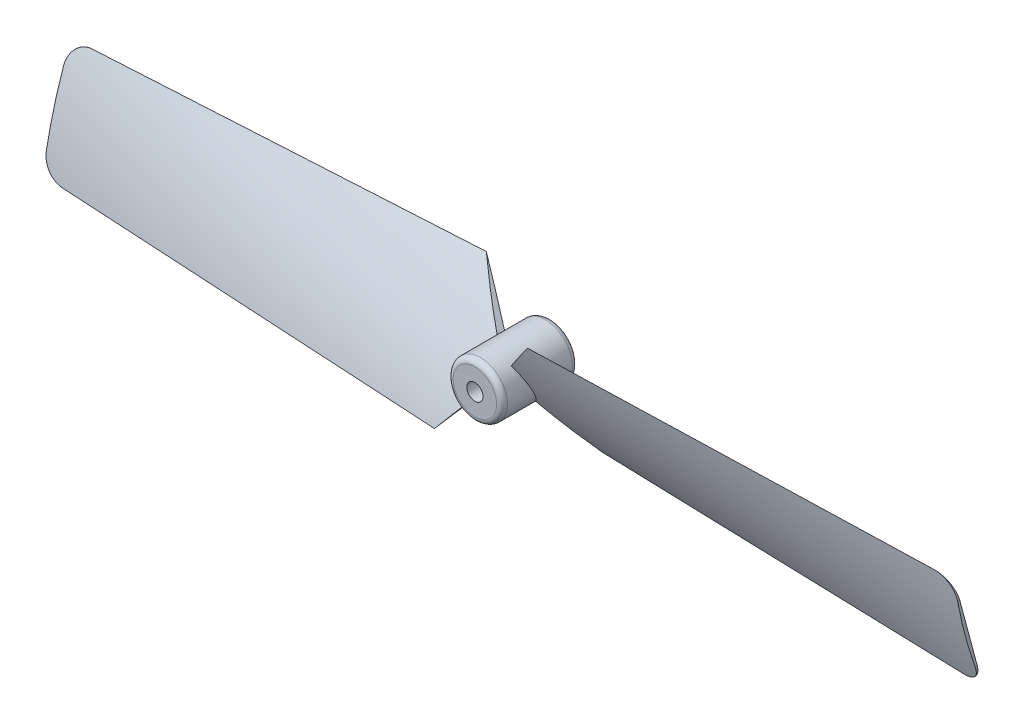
from build123d import *

# Parameters (mm, degrees)
ESQUISSE1_R                  = 2.5
EXTRUSION1_DEPTH             = 3.5
ENL_V_MAT_EXTRU_1_DEPTH      = 40
ESQUISSE5_R                  = 0.75
ENL_V_MAT_EXTRU_2_DEPTH      = 43.914523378
R_P_TITION_CIRCULAIRE1_COUNT = 2
CONG_1_R                     = 0.5


with BuildPart() as part:
    # Esquisse1 → Extrusion1 (new, symmetric)
    with BuildSketch(Plane.XY):
        Circle(ESQUISSE1_R)
    extrude(amount=EXTRUSION1_DEPTH, both=True)

    # Esquisse2 for Lissage1 → Lissage1 section 0
    with BuildSketch(Plane(origin=(0, 0, 0), x_dir=(0, 0, -1), z_dir=(1, 0, 0))):
        with BuildLine():
            Line((3.125, -5.412658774), (-3.125, 5.412658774))
            # circular arc as an exact rational Bezier (weights 1, cos(half-angle), 1)
            Bezier((-3.125, 5.412658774), (-1.152935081, -0.665647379), (3.125, -5.412658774), weights=[1, 0.978057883, 1])
        make_face()
    # Esquisse3 for Lissage1 → Lissage1 section 1
    with BuildSketch(Plane(origin=(42, 0, 0), x_dir=(0, 0, -1), z_dir=(1, 0, 0))):
        with BuildLine():
            Line((-1.294095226, 4.829629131), (1.294095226, -4.829629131))
            Bezier((1.294095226, -4.829629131), (-0.608476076, -0.163040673), (-1.294095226, 4.829629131), weights=[1, 0.992156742, 1])
        make_face()
    lissage1 = loft()

    # Esquisse4 → Enl_v. mat.-Extru.1 (cut, symmetric)
    with BuildSketch(Plane.XY.offset(3.5)):
        with BuildLine():
            Line((0, 2.5), (0, 8.363656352))
            Line((0, 8.363656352), (6.696744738, 8.363656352))
            Line((6.696744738, 8.363656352), (1.562565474, 1.951509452))
            ThreePointArc((1.562565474, 1.951509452), (0.828017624, 2.358895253), (0, 2.5))
        make_face()
        with BuildLine():
            Line((0, -2.5), (0, -7.360181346))
            Line((0, -7.360181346), (7.361277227, -7.360181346))
            Line((7.361277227, -7.360181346), (1.767898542, -1.767635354))
            ThreePointArc((1.767898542, -1.767635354), (0.956794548, -2.30966322), (0, -2.5))
        make_face()
    enl_v_mat_extru_1 = extrude(amount=ENL_V_MAT_EXTRU_1_DEPTH, both=True, mode=Mode.SUBTRACT)

    # Esquisse5 → Enl_v. mat.-Extru.2 (cut, through all)
    with BuildSketch(Plane.XY.offset(3.5)):
        Circle(ESQUISSE5_R)
        with BuildLine():
            Line((42, 3), (42, -3))
            ThreePointArc((42, -3), (41.471863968, -4.296407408), (40.188153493, -4.854696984))
            Line((40.188153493, -4.854696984), (40.188153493, -7.608169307))
            Line((40.188153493, -7.608169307), (45.818162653, -7.608169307))
            Line((45.818162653, -7.608169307), (45.818162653, 7.078852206))
            Line((45.818162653, 7.078852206), (40.188153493, 7.078852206))
            Line((40.188153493, 7.078852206), (40.188153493, 4.854696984))
            ThreePointArc((40.188153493, 4.854696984), (41.471863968, 4.296407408), (42, 3))
        make_face()
    enl_v_mat_extru_2 = extrude(amount=-ENL_V_MAT_EXTRU_2_DEPTH, mode=Mode.SUBTRACT)

    # R_p_tition circulaire1: Lissage1, Enl_v. mat.-Extru.1, Enl_v. mat.-Extru.2 ×2 about axis
    r_p_tition_circulaire1_axis = Axis((0, 0, 3.5), (0, 0, -1))
    add([lissage1.rotate(r_p_tition_circulaire1_axis, i * 360 / R_P_TITION_CIRCULAIRE1_COUNT) for i in range(1, R_P_TITION_CIRCULAIRE1_COUNT)])
    add([enl_v_mat_extru_1.rotate(r_p_tition_circulaire1_axis, i * 360 / R_P_TITION_CIRCULAIRE1_COUNT) for i in range(1, R_P_TITION_CIRCULAIRE1_COUNT)], mode=Mode.SUBTRACT)
    add([enl_v_mat_extru_2.rotate(r_p_tition_circulaire1_axis, i * 360 / R_P_TITION_CIRCULAIRE1_COUNT) for i in range(1, R_P_TITION_CIRCULAIRE1_COUNT)], mode=Mode.SUBTRACT)

    # Cong_1
    cong_1_edges = [part.edges().sort_by_distance(p)[0] for p in [
        (2.309734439, -0.956622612, -3.5),
        (2.253487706, 1.082493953, 3.5),
    ]]
    fillet(cong_1_edges, radius=CONG_1_R)


solid = part.part
